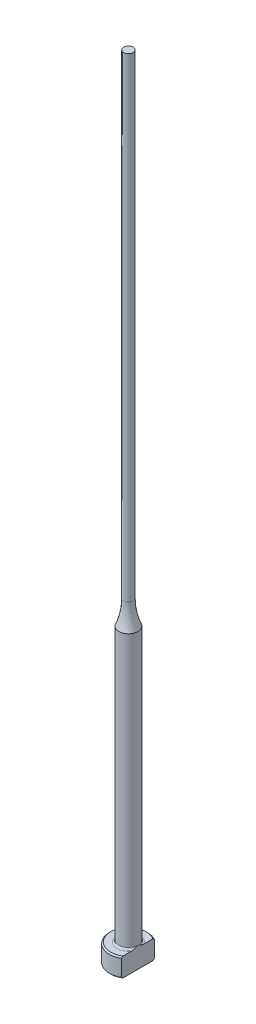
from build123d import *
from build123d.topology import SkipClean

# Parameters (mm, degrees)
CHAMFER1_SIZE = 0.2
FILLET1_R     = 0.3
KEY_DEPTH     = 126.071979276


with BuildPart() as part:
    # Sketch1 → Revolve1 (revolve)
    with BuildSketch(Plane.XY, mode=Mode.PRIVATE) as revolve1_sk:
        with BuildLine():
            Line((0, 0), (-3, 0))
            Line((-3, 0), (-3, 3))
            Line((-3, 3), (-1.5, 3))
            Line((-1.5, 3), (-1.5, 46.200328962))
            ThreePointArc((-1.5, 46.200328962), (-0.939291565, 48.063508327), (-0.75, 50))
            Line((-0.75, 50), (-0.75, 125))
            Line((-0.75, 125), (0, 125))
            Line((0, 125), (0, 0))
        make_face()
    revolve(revolve1_sk.sketch.rotate(Axis((0, 259.958771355, 0), (0, -1, 0)), 270), axis=Axis((0, 259.958771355, 0), (0, -1, 0)))

    # Chamfer1
    chamfer1_edges = [part.edges().sort_by_distance(p)[0] for p in [
        (0, 0, -3),
        (0, 3, -3),
    ]]
    chamfer(chamfer1_edges, length=CHAMFER1_SIZE)

    # Fillet1
    fillet1_edges = [part.edges().sort_by_distance(p)[0] for p in [
        (0, 3, -1.5),
    ]]
    fillet(fillet1_edges, radius=FILLET1_R)

    # Sketch2 → KEY (cut, through all)
    with SkipClean():  # the faces are left unmerged after this step: merging them gives an invalid solid
        with BuildSketch(Plane(origin=(0, 0, 0), x_dir=(1, 0, 0), z_dir=(0, 1, 0))):
            with BuildLine():
                Line((1.5, 2.598076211), (1.5, -2.598076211))
                ThreePointArc((1.5, -2.598076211), (3, 0), (1.5, 2.598076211))
            make_face()
        extrude(amount=KEY_DEPTH, mode=Mode.SUBTRACT)


solid = part.part
